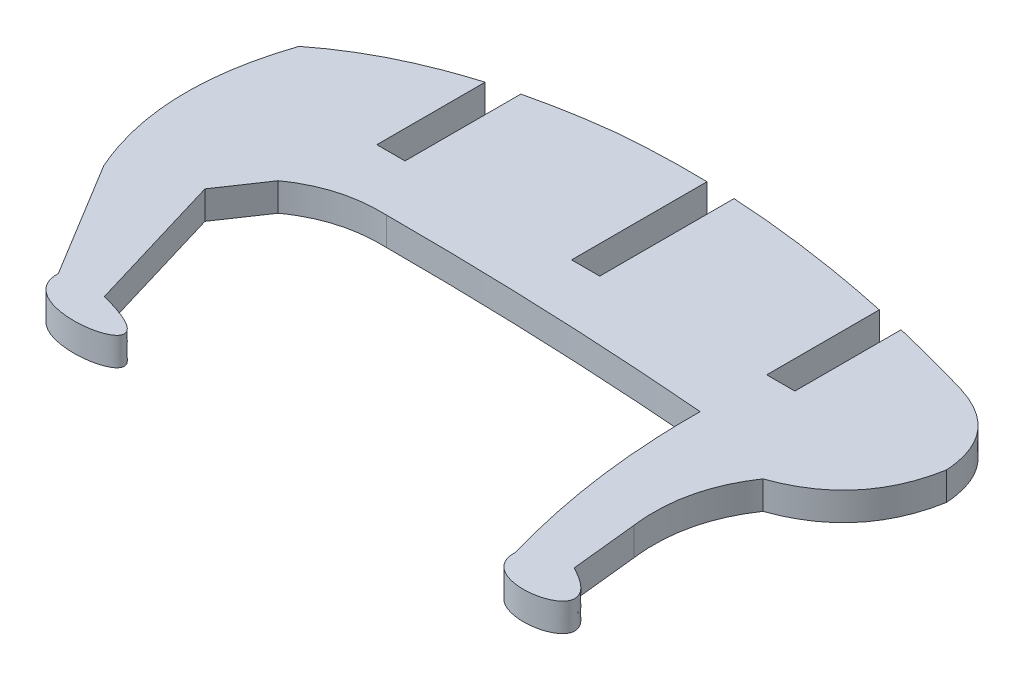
from build123d import *

# Parameters (mm, degrees)
SALIENTE_EXTRUIR1_DEPTH = 3


with BuildPart() as part:
    # Croquis2 → Saliente-Extruir1 (new body)
    with BuildSketch(Plane(origin=(0, 0, 0), x_dir=(1, 0, 0), z_dir=(0, 1, 0))):
        with BuildLine():
            Line((-7.233716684, 4.643674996), (-10.374158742, 0))
            Line((-10.374158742, 0), (-5.793420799, -15.302652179))
            add(Edge.make_bspline(
                [(-10.374158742, -15.617594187), (-10.591791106, -22.007726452), (6.612776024, -18.370201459), (-5.793420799, -15.302652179)],
                knots=[0, 0, 0, 0, 1, 1, 1, 1], degree=3))
            Line((-10.374158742, -15.617594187), (-17.907658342, -3.243952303))
            add(Edge.make_bspline(
                [(-18.516922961, 18.150768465), (-22.338239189, 6.780590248), (-17.907658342, -3.243952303)],
                knots=[0, 0, 0, 1, 1, 1], degree=2))
            add(Edge.make_bspline(
                [(-18.516922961, 18.150768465), (-16.02936888, 20.125160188), (-11.718402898, 22.579257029), (-7.024278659, 24.247555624), (-5.293400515, 24.765059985)],
                knots=[0.333246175, 0.333246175, 0.333246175, 0.333246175, 0.571137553, 0.706215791, 0.706215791, 0.706215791, 0.706215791], degree=3))
            Line((-5.293400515, 24.765059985), (-5.293400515, 13.232020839))
            Line((-5.293400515, 13.232020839), (-2.293400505, 13.232020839))
            Line((-2.293400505, 13.232020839), (-2.293400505, 25.571830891))
            add(Edge.make_bspline(
                [(-2.293400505, 25.571830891), (1.936182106, 26.589886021), (6.237286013, 27.079665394)],
                knots=[0.783562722, 0.783562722, 0.783562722, 1, 1, 1], degree=2))
            add(Edge.make_bspline(
                [(6.237286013, 27.079665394), (9.270834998, 27.372599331), (12.427272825, 27.480949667), (15.706599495, 27.404716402)],
                knots=[0.396665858, 0.396665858, 0.396665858, 0.396665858, 0.54813025, 0.54813025, 0.54813025, 0.54813025], degree=3))
            Line((15.706599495, 27.404716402), (15.706599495, 12.978867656))
            Line((15.706599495, 12.978867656), (18.7065995, 12.978867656))
            Line((18.7065995, 12.978867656), (18.7065995, 27.285407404))
            add(Edge.make_bspline(
                [(18.7065995, 27.285407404), (24.357629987, 26.969359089), (30.357629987, 26.129145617), (36.7065995, 24.764766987)],
                knots=[0.59380183, 0.59380183, 0.59380183, 0.59380183, 0.849041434, 0.849041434, 0.849041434, 0.849041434], degree=3))
            Line((36.7065995, 24.764766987), (36.7065995, 12.76745739))
            Line((36.7065995, 12.76745739), (39.706599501, 12.76745739))
            Line((39.706599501, 12.76745739), (39.706599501, 24.087211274))
            add(Edge.make_bspline(
                [(39.706599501, 24.087211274), (43.923067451, 23.089505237), (48.337885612, 21.793869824)],
                knots=[0.888901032, 0.888901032, 0.888901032, 1, 1, 1], degree=2))
            add(Edge.make_bspline(
                [(48.337885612, 21.793869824), (54.650254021, 19.854880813), (55.05664845, 13.565418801)],
                knots=[0, 0, 0, 1, 1, 1], degree=2))
            add(Edge.make_bspline(
                [(55.05664845, 13.565418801), (53.645634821, 5.612443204), (46.099771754, 2.963984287)],
                knots=[0, 0, 0, 1, 1, 1], degree=2))
            add(Edge.make_bspline(
                [(46.099771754, 2.963984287), (42.720416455, -1.995745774), (43.515865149, -8.186715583)],
                knots=[0, 0, 0, 1, 1, 1], degree=2))
            Line((43.515865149, -8.186715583), (44.266031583, -15.302652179))
            add(Edge.make_bspline(
                [(44.266031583, -15.302652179), (52.821348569, -19.62846649), (39.385399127, -22.423288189), (39.706599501, -16.976444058)],
                knots=[0, 0, 0, 0, 1, 1, 1, 1], degree=3))
            add(Edge.make_bspline(
                [(39.706599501, -16.976444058), (36.419845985, -5.745812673), (36.557355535, 5.829267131)],
                knots=[0, 0, 0, 1, 1, 1], degree=2))
            add(Edge.make_bspline(
                [(36.557355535, 5.829267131), (24.950059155, 6.789518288), (13.329095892, 7.264567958), (1.694465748, 7.25441614)],
                knots=[0.259120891, 0.259120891, 0.259120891, 0.259120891, 1, 1, 1, 1], degree=3))
            add(Edge.make_bspline(
                [(1.694465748, 7.25441614), (-3.387128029, 7.431978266), (-7.233716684, 4.643674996)],
                knots=[0, 0, 0, 1, 1, 1], degree=2))
        make_face()
    extrude(amount=SALIENTE_EXTRUIR1_DEPTH)


solid = part.part
